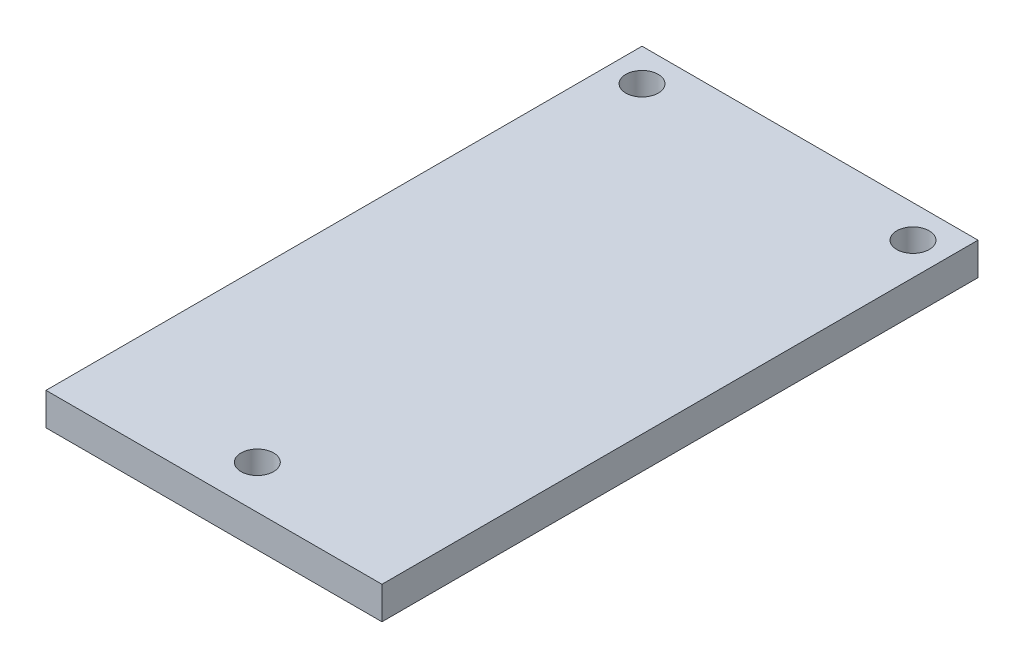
from build123d import *

# Parameters (mm, degrees)
SKETCH1_W      = 62
SKETCH1_H      = 110
SKETCH1_R      = 3
EXTRUDE1_DEPTH = 6


with BuildPart() as part:
    # Sketch1 → Extrude1 (new body)
    with BuildSketch(Plane(origin=(0, 0, 0), x_dir=(1, 0, 0), z_dir=(0, 1, 0))):
        with Locations((31, 55)):
            Rectangle(SKETCH1_W, SKETCH1_H)
        with Locations(Location((31, 8, 0), (0, 0, 270))):
            Circle(SKETCH1_R, mode=Mode.SUBTRACT)
        with Locations(Location((6, 104, 0), (0, 0, 270))):
            Circle(SKETCH1_R, mode=Mode.SUBTRACT)
        with Locations(Location((56, 104, 0), (0, 0, 270))):
            Circle(SKETCH1_R, mode=Mode.SUBTRACT)
    extrude(amount=EXTRUDE1_DEPTH)


solid = part.part
